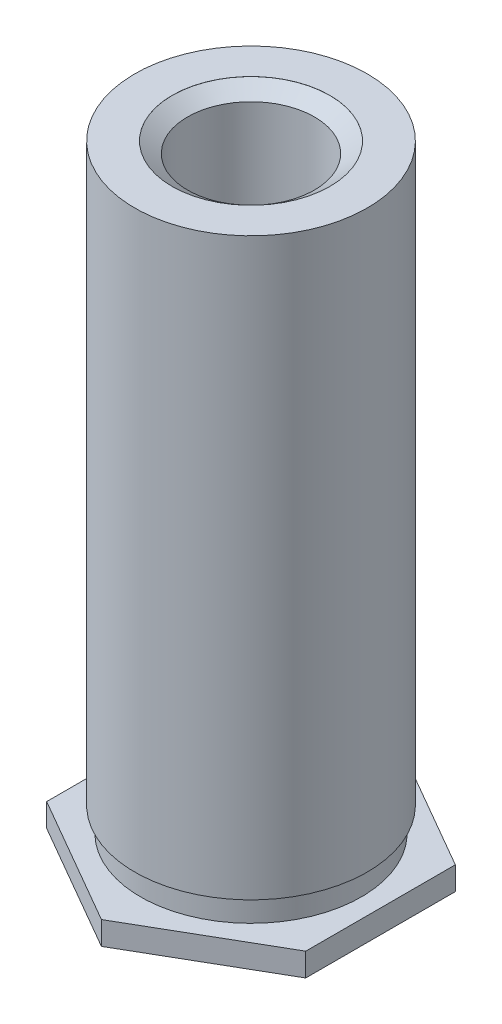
from build123d import *

# Parameters (mm, degrees)
HEXDIESKE_R  = 4.609084
HEXDIE_DEPTH = 0.7112


with BuildPart() as part:
    # BodySke → Body (revolve)
    with BuildSketch(Plane.XY, mode=Mode.PRIVATE) as body_sk:
        Polygon((3.556, 0), (4.596384, 0), (4.596384, 0.7112), (3.3782, 0.7112), (3.3782, 1.45796), (3.556, 1.45796), (3.556, 19.05), (1.94056, 19.05), (1.94056, 9.525), (0, 9.525), (0, 0.00254), (3.556, 0.00254), align=None)
    revolve(body_sk.sketch.rotate(Axis((0, 0, 0), (0, 1, 0)), 90), axis=Axis((0, 0, 0), (0, 1, 0)))

    # TapDriSke → TapDrill (revolve, cut)
    with BuildSketch(Plane.XY, mode=Mode.PRIVATE) as tapdrill_sk:
        Polygon((1.94056, 5.5626), (1.94056, 19.05), (0, 19.05), (0, 4.758793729), align=None)
    revolve(tapdrill_sk.sketch.rotate(Axis((0, 0, 0), (0, 1, 0)), 90), axis=Axis((0, 0, 0), (0, 1, 0)), mode=Mode.SUBTRACT)

    # EndChamferSke → EndChamfer (revolve, cut)
    with BuildSketch(Plane.XY, mode=Mode.PRIVATE) as endchamfer_sk:
        Polygon((2.413, 19.04746), (1.94056, 18.71677682), (1.94056, 19.304), (2.413, 19.304), align=None)
    revolve(endchamfer_sk.sketch.rotate(Axis((0, -2.54, 0), (0, 1, 0)), 90), axis=Axis((0, -2.54, 0), (0, 1, 0)), mode=Mode.SUBTRACT)

    # HexDieSke → HexDie (cut)
    with BuildSketch(Plane(origin=(0, 0.7112, 0), x_dir=(-1, 0, 0), z_dir=(0, 1, 0))):
        Circle(HEXDIESKE_R)
        Polygon((0, 4.575385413), (3.9624, 2.287692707), (3.9624, -2.287692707), (0, -4.575385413), (-3.9624, -2.287692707), (-3.9624, 2.287692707), align=None, mode=Mode.SUBTRACT)
    extrude(amount=-HEXDIE_DEPTH, mode=Mode.SUBTRACT)


solid = part.part
